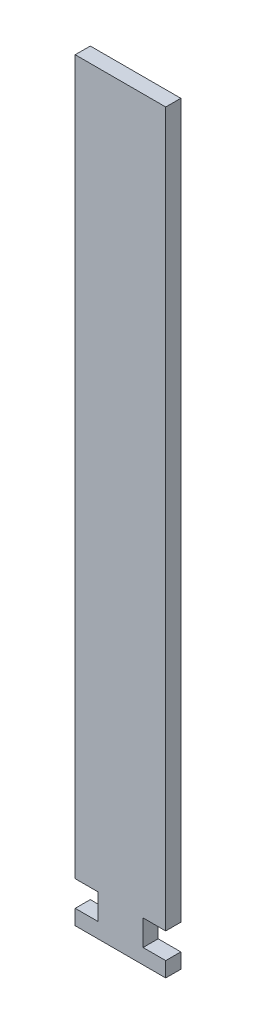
ISO-10303-21;
HEADER;
FILE_DESCRIPTION(('STEP AP214'),'2;1');
FILE_NAME('part.step','',(''),(''),'','','');
FILE_SCHEMA(('AUTOMOTIVE_DESIGN { 1 0 10303 214 1 1 1 1 }'));
ENDSEC;
DATA;
#1=APPLICATION_CONTEXT('core data for automotive mechanical design processes');
#2=APPLICATION_PROTOCOL_DEFINITION('international standard','automotive_design',2000,#1);
#3=PRODUCT_CONTEXT('',#1,'mechanical');
#4=PRODUCT('Part','Part','',(#3));
#5=PRODUCT_RELATED_PRODUCT_CATEGORY('part','',(#4));
#6=PRODUCT_DEFINITION_FORMATION('','',#4);
#7=PRODUCT_DEFINITION_CONTEXT('part definition',#1,'design');
#8=PRODUCT_DEFINITION('design','',#6,#7);
#9=PRODUCT_DEFINITION_SHAPE('','',#8);
#10=(LENGTH_UNIT() NAMED_UNIT(*) SI_UNIT(.MILLI.,.METRE.));
#11=(NAMED_UNIT(*) PLANE_ANGLE_UNIT() SI_UNIT($,.RADIAN.));
#12=(NAMED_UNIT(*) SI_UNIT($,.STERADIAN.) SOLID_ANGLE_UNIT());
#13=UNCERTAINTY_MEASURE_WITH_UNIT(LENGTH_MEASURE(1.E-05),#10,'distance_accuracy_value','');
#14=(GEOMETRIC_REPRESENTATION_CONTEXT(3) GLOBAL_UNCERTAINTY_ASSIGNED_CONTEXT((#13)) GLOBAL_UNIT_ASSIGNED_CONTEXT((#10,
#11,#12)) REPRESENTATION_CONTEXT('',''));
#15=CARTESIAN_POINT('',(0.,0.,0.));
#16=DIRECTION('',(0.,0.,1.));
#17=DIRECTION('',(1.,0.,0.));
#18=AXIS2_PLACEMENT_3D('',#15,#16,#17);
#19=CARTESIAN_POINT('',(-79.8414971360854,-49.6987951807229,10.));
#20=DIRECTION('',(1.,0.,0.));
#21=DIRECTION('',(0.,0.,-1.));
#22=AXIS2_PLACEMENT_3D('',#19,#20,#21);
#23=PLANE('',#22);
#24=DIRECTION('',(0.,-1.,0.));
#25=VECTOR('',#24,1.);
#26=CARTESIAN_POINT('',(-79.8414971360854,-49.6987951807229,0.));
#27=LINE('',#26,#25);
#28=CARTESIAN_POINT('',(-79.8414971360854,450.301204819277,0.));
#29=VERTEX_POINT('',#28);
#30=CARTESIAN_POINT('',(-79.8414971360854,-22.6987951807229,0.));
#31=VERTEX_POINT('',#30);
#32=EDGE_CURVE('E144',#29,#31,#27,.T.);
#33=ORIENTED_EDGE('',*,*,#32,.T.);
#34=DIRECTION('',(0.,0.,1.));
#35=VECTOR('',#34,1.);
#36=CARTESIAN_POINT('',(-79.8414971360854,-22.6987951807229,0.));
#37=LINE('',#36,#35);
#38=CARTESIAN_POINT('',(-79.8414971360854,-22.6987951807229,10.));
#39=VERTEX_POINT('',#38);
#40=EDGE_CURVE('E193',#31,#39,#37,.T.);
#41=ORIENTED_EDGE('',*,*,#40,.T.);
#42=DIRECTION('',(0.,-1.,0.));
#43=VECTOR('',#42,1.);
#44=CARTESIAN_POINT('',(-79.8414971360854,-49.6987951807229,10.));
#45=LINE('',#44,#43);
#46=CARTESIAN_POINT('',(-79.8414971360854,450.301204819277,10.));
#47=VERTEX_POINT('',#46);
#48=EDGE_CURVE('E200',#47,#39,#45,.T.);
#49=ORIENTED_EDGE('',*,*,#48,.F.);
#50=DIRECTION('',(0.,0.,-1.));
#51=VECTOR('',#50,1.);
#52=CARTESIAN_POINT('',(-79.8414971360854,450.301204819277,10.));
#53=LINE('',#52,#51);
#54=EDGE_CURVE('E162',#47,#29,#53,.T.);
#55=ORIENTED_EDGE('',*,*,#54,.T.);
#56=EDGE_LOOP('',(#33,#41,#49,#55));
#57=FACE_BOUND('',#56,.T.);
#58=ADVANCED_FACE('F33',(#57),#23,.F.);
#59=CARTESIAN_POINT('',(-19.8414971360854,-49.6987951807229,10.));
#60=DIRECTION('',(-1.,0.,0.));
#61=DIRECTION('',(0.,0.,1.));
#62=AXIS2_PLACEMENT_3D('',#59,#60,#61);
#63=PLANE('',#62);
#64=DIRECTION('',(0.,1.,0.));
#65=VECTOR('',#64,1.);
#66=CARTESIAN_POINT('',(-19.8414971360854,-49.6987951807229,0.));
#67=LINE('',#66,#65);
#68=CARTESIAN_POINT('',(-19.8414971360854,-49.6987951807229,0.));
#69=VERTEX_POINT('',#68);
#70=CARTESIAN_POINT('',(-19.8414971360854,-39.6987951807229,0.));
#71=VERTEX_POINT('',#70);
#72=EDGE_CURVE('E157',#69,#71,#67,.T.);
#73=ORIENTED_EDGE('',*,*,#72,.T.);
#74=DIRECTION('',(0.,0.,1.));
#75=VECTOR('',#74,1.);
#76=CARTESIAN_POINT('',(-19.8414971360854,-39.6987951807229,0.));
#77=LINE('',#76,#75);
#78=CARTESIAN_POINT('',(-19.8414971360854,-39.6987951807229,10.));
#79=VERTEX_POINT('',#78);
#80=EDGE_CURVE('E145',#71,#79,#77,.T.);
#81=ORIENTED_EDGE('',*,*,#80,.T.);
#82=DIRECTION('',(0.,1.,0.));
#83=VECTOR('',#82,1.);
#84=CARTESIAN_POINT('',(-19.8414971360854,-49.6987951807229,10.));
#85=LINE('',#84,#83);
#86=CARTESIAN_POINT('',(-19.8414971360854,-49.6987951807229,10.));
#87=VERTEX_POINT('',#86);
#88=EDGE_CURVE('E173',#87,#79,#85,.T.);
#89=ORIENTED_EDGE('',*,*,#88,.F.);
#90=DIRECTION('',(0.,0.,-1.));
#91=VECTOR('',#90,1.);
#92=CARTESIAN_POINT('',(-19.8414971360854,-49.6987951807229,10.));
#93=LINE('',#92,#91);
#94=EDGE_CURVE('E41',#87,#69,#93,.T.);
#95=ORIENTED_EDGE('',*,*,#94,.T.);
#96=EDGE_LOOP('',(#73,#81,#89,#95));
#97=FACE_BOUND('',#96,.T.);
#98=ADVANCED_FACE('F171',(#97),#63,.F.);
#99=CARTESIAN_POINT('',(-79.8414971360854,-39.6987951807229,10.));
#100=VERTEX_POINT('',#99);
#101=CARTESIAN_POINT('',(-79.8414971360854,-49.6987951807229,10.));
#102=VERTEX_POINT('',#101);
#103=EDGE_CURVE('E137',#100,#102,#45,.T.);
#104=ORIENTED_EDGE('',*,*,#103,.F.);
#105=DIRECTION('',(0.,0.,1.));
#106=VECTOR('',#105,1.);
#107=CARTESIAN_POINT('',(-79.8414971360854,-39.6987951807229,0.));
#108=LINE('',#107,#106);
#109=CARTESIAN_POINT('',(-79.8414971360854,-39.6987951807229,0.));
#110=VERTEX_POINT('',#109);
#111=EDGE_CURVE('E125',#110,#100,#108,.T.);
#112=ORIENTED_EDGE('',*,*,#111,.F.);
#113=CARTESIAN_POINT('',(-79.8414971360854,-49.6987951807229,0.));
#114=VERTEX_POINT('',#113);
#115=EDGE_CURVE('E135',#110,#114,#27,.T.);
#116=ORIENTED_EDGE('',*,*,#115,.T.);
#117=DIRECTION('',(0.,0.,-1.));
#118=VECTOR('',#117,1.);
#119=CARTESIAN_POINT('',(-79.8414971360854,-49.6987951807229,10.));
#120=LINE('',#119,#118);
#121=EDGE_CURVE('E11',#102,#114,#120,.T.);
#122=ORIENTED_EDGE('',*,*,#121,.F.);
#123=EDGE_LOOP('',(#104,#112,#116,#122));
#124=FACE_BOUND('',#123,.T.);
#125=ADVANCED_FACE('F35',(#124),#23,.F.);
#126=CARTESIAN_POINT('',(-79.8414971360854,-49.6987951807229,10.));
#127=DIRECTION('',(0.,1.,0.));
#128=DIRECTION('',(0.,0.,1.));
#129=AXIS2_PLACEMENT_3D('',#126,#127,#128);
#130=PLANE('',#129);
#131=DIRECTION('',(1.,0.,0.));
#132=VECTOR('',#131,1.);
#133=CARTESIAN_POINT('',(-79.8414971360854,-49.6987951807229,0.));
#134=LINE('',#133,#132);
#135=EDGE_CURVE('E143',#114,#69,#134,.T.);
#136=ORIENTED_EDGE('',*,*,#135,.T.);
#137=ORIENTED_EDGE('',*,*,#94,.F.);
#138=DIRECTION('',(1.,0.,0.));
#139=VECTOR('',#138,1.);
#140=CARTESIAN_POINT('',(-79.8414971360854,-49.6987951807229,10.));
#141=LINE('',#140,#139);
#142=EDGE_CURVE('E203',#102,#87,#141,.T.);
#143=ORIENTED_EDGE('',*,*,#142,.F.);
#144=ORIENTED_EDGE('',*,*,#121,.T.);
#145=EDGE_LOOP('',(#136,#137,#143,#144));
#146=FACE_BOUND('',#145,.T.);
#147=ADVANCED_FACE('F259',(#146),#130,.F.);
#148=CARTESIAN_POINT('',(-19.8414971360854,-22.6987951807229,10.));
#149=VERTEX_POINT('',#148);
#150=CARTESIAN_POINT('',(-19.8414971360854,450.301204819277,10.));
#151=VERTEX_POINT('',#150);
#152=EDGE_CURVE('E204',#149,#151,#85,.T.);
#153=ORIENTED_EDGE('',*,*,#152,.F.);
#154=DIRECTION('',(0.,0.,1.));
#155=VECTOR('',#154,1.);
#156=CARTESIAN_POINT('',(-19.8414971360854,-22.6987951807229,0.));
#157=LINE('',#156,#155);
#158=CARTESIAN_POINT('',(-19.8414971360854,-22.6987951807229,0.));
#159=VERTEX_POINT('',#158);
#160=EDGE_CURVE('E181',#159,#149,#157,.T.);
#161=ORIENTED_EDGE('',*,*,#160,.F.);
#162=CARTESIAN_POINT('',(-19.8414971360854,450.301204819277,0.));
#163=VERTEX_POINT('',#162);
#164=EDGE_CURVE('E156',#159,#163,#67,.T.);
#165=ORIENTED_EDGE('',*,*,#164,.T.);
#166=DIRECTION('',(0.,0.,-1.));
#167=VECTOR('',#166,1.);
#168=CARTESIAN_POINT('',(-19.8414971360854,450.301204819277,10.));
#169=LINE('',#168,#167);
#170=EDGE_CURVE('E165',#151,#163,#169,.T.);
#171=ORIENTED_EDGE('',*,*,#170,.F.);
#172=EDGE_LOOP('',(#153,#161,#165,#171));
#173=FACE_BOUND('',#172,.T.);
#174=ADVANCED_FACE('F216',(#173),#63,.F.);
#175=CARTESIAN_POINT('',(-79.8414971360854,450.301204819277,10.));
#176=DIRECTION('',(0.,-1.,0.));
#177=DIRECTION('',(0.,0.,-1.));
#178=AXIS2_PLACEMENT_3D('',#175,#176,#177);
#179=PLANE('',#178);
#180=DIRECTION('',(-1.,0.,0.));
#181=VECTOR('',#180,1.);
#182=CARTESIAN_POINT('',(-79.8414971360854,450.301204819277,0.));
#183=LINE('',#182,#181);
#184=EDGE_CURVE('E160',#163,#29,#183,.T.);
#185=ORIENTED_EDGE('',*,*,#184,.T.);
#186=ORIENTED_EDGE('',*,*,#54,.F.);
#187=DIRECTION('',(-1.,0.,0.));
#188=VECTOR('',#187,1.);
#189=CARTESIAN_POINT('',(-79.8414971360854,450.301204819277,10.));
#190=LINE('',#189,#188);
#191=EDGE_CURVE('E153',#151,#47,#190,.T.);
#192=ORIENTED_EDGE('',*,*,#191,.F.);
#193=ORIENTED_EDGE('',*,*,#170,.T.);
#194=EDGE_LOOP('',(#185,#186,#192,#193));
#195=FACE_BOUND('',#194,.T.);
#196=ADVANCED_FACE('F220',(#195),#179,.F.);
#197=CARTESIAN_POINT('',(0.,0.,10.));
#198=DIRECTION('',(0.,0.,-1.));
#199=DIRECTION('',(-1.,0.,0.));
#200=AXIS2_PLACEMENT_3D('',#197,#198,#199);
#201=PLANE('',#200);
#202=ORIENTED_EDGE('',*,*,#48,.T.);
#203=DIRECTION('',(-1.,0.,0.));
#204=VECTOR('',#203,1.);
#205=CARTESIAN_POINT('',(-79.8414971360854,-22.6987951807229,10.));
#206=LINE('',#205,#204);
#207=CARTESIAN_POINT('',(-64.8414971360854,-22.6987951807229,10.));
#208=VERTEX_POINT('',#207);
#209=EDGE_CURVE('E130',#208,#39,#206,.T.);
#210=ORIENTED_EDGE('',*,*,#209,.F.);
#211=DIRECTION('',(0.,1.,0.));
#212=VECTOR('',#211,1.);
#213=CARTESIAN_POINT('',(-64.8414971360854,-39.6987951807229,10.));
#214=LINE('',#213,#212);
#215=CARTESIAN_POINT('',(-64.8414971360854,-39.6987951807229,10.));
#216=VERTEX_POINT('',#215);
#217=EDGE_CURVE('E228',#216,#208,#214,.T.);
#218=ORIENTED_EDGE('',*,*,#217,.F.);
#219=DIRECTION('',(1.,0.,0.));
#220=VECTOR('',#219,1.);
#221=CARTESIAN_POINT('',(-79.8414971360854,-39.6987951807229,10.));
#222=LINE('',#221,#220);
#223=EDGE_CURVE('E231',#100,#216,#222,.T.);
#224=ORIENTED_EDGE('',*,*,#223,.F.);
#225=ORIENTED_EDGE('',*,*,#103,.T.);
#226=ORIENTED_EDGE('',*,*,#142,.T.);
#227=ORIENTED_EDGE('',*,*,#88,.T.);
#228=DIRECTION('',(1.,0.,0.));
#229=VECTOR('',#228,1.);
#230=CARTESIAN_POINT('',(-19.8414971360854,-39.6987951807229,10.));
#231=LINE('',#230,#229);
#232=CARTESIAN_POINT('',(-34.8414971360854,-39.6987951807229,10.));
#233=VERTEX_POINT('',#232);
#234=EDGE_CURVE('E196',#233,#79,#231,.T.);
#235=ORIENTED_EDGE('',*,*,#234,.F.);
#236=DIRECTION('',(0.,-1.,0.));
#237=VECTOR('',#236,1.);
#238=CARTESIAN_POINT('',(-34.8414971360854,-39.6987951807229,10.));
#239=LINE('',#238,#237);
#240=CARTESIAN_POINT('',(-34.8414971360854,-22.6987951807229,10.));
#241=VERTEX_POINT('',#240);
#242=EDGE_CURVE('E192',#241,#233,#239,.T.);
#243=ORIENTED_EDGE('',*,*,#242,.F.);
#244=DIRECTION('',(-1.,0.,0.));
#245=VECTOR('',#244,1.);
#246=CARTESIAN_POINT('',(-19.8414971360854,-22.6987951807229,10.));
#247=LINE('',#246,#245);
#248=EDGE_CURVE('E189',#149,#241,#247,.T.);
#249=ORIENTED_EDGE('',*,*,#248,.F.);
#250=ORIENTED_EDGE('',*,*,#152,.T.);
#251=ORIENTED_EDGE('',*,*,#191,.T.);
#252=EDGE_LOOP('',(#202,#210,#218,#224,#225,#226,#227,#235,#243,#249,#250,#251));
#253=FACE_BOUND('',#252,.T.);
#254=ADVANCED_FACE('F210',(#253),#201,.F.);
#255=CARTESIAN_POINT('',(0.,0.,0.));
#256=DIRECTION('',(0.,0.,-1.));
#257=DIRECTION('',(-1.,0.,0.));
#258=AXIS2_PLACEMENT_3D('',#255,#256,#257);
#259=PLANE('',#258);
#260=DIRECTION('',(-1.,0.,0.));
#261=VECTOR('',#260,1.);
#262=CARTESIAN_POINT('',(-79.8414971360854,-22.6987951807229,0.));
#263=LINE('',#262,#261);
#264=CARTESIAN_POINT('',(-64.8414971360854,-22.6987951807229,0.));
#265=VERTEX_POINT('',#264);
#266=EDGE_CURVE('E138',#265,#31,#263,.T.);
#267=ORIENTED_EDGE('',*,*,#266,.T.);
#268=ORIENTED_EDGE('',*,*,#32,.F.);
#269=ORIENTED_EDGE('',*,*,#184,.F.);
#270=ORIENTED_EDGE('',*,*,#164,.F.);
#271=DIRECTION('',(-1.,0.,0.));
#272=VECTOR('',#271,1.);
#273=CARTESIAN_POINT('',(-19.8414971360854,-22.6987951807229,0.));
#274=LINE('',#273,#272);
#275=CARTESIAN_POINT('',(-34.8414971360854,-22.6987951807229,0.));
#276=VERTEX_POINT('',#275);
#277=EDGE_CURVE('E185',#159,#276,#274,.T.);
#278=ORIENTED_EDGE('',*,*,#277,.T.);
#279=DIRECTION('',(0.,-1.,0.));
#280=VECTOR('',#279,1.);
#281=CARTESIAN_POINT('',(-34.8414971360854,-39.6987951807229,0.));
#282=LINE('',#281,#280);
#283=CARTESIAN_POINT('',(-34.8414971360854,-39.6987951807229,0.));
#284=VERTEX_POINT('',#283);
#285=EDGE_CURVE('E56',#276,#284,#282,.T.);
#286=ORIENTED_EDGE('',*,*,#285,.T.);
#287=DIRECTION('',(1.,0.,0.));
#288=VECTOR('',#287,1.);
#289=CARTESIAN_POINT('',(-19.8414971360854,-39.6987951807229,0.));
#290=LINE('',#289,#288);
#291=EDGE_CURVE('E178',#284,#71,#290,.T.);
#292=ORIENTED_EDGE('',*,*,#291,.T.);
#293=ORIENTED_EDGE('',*,*,#72,.F.);
#294=ORIENTED_EDGE('',*,*,#135,.F.);
#295=ORIENTED_EDGE('',*,*,#115,.F.);
#296=DIRECTION('',(1.,0.,0.));
#297=VECTOR('',#296,1.);
#298=CARTESIAN_POINT('',(-79.8414971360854,-39.6987951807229,0.));
#299=LINE('',#298,#297);
#300=CARTESIAN_POINT('',(-64.8414971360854,-39.6987951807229,0.));
#301=VERTEX_POINT('',#300);
#302=EDGE_CURVE('E121',#110,#301,#299,.T.);
#303=ORIENTED_EDGE('',*,*,#302,.T.);
#304=DIRECTION('',(0.,1.,0.));
#305=VECTOR('',#304,1.);
#306=CARTESIAN_POINT('',(-64.8414971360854,-39.6987951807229,0.));
#307=LINE('',#306,#305);
#308=EDGE_CURVE('E48',#301,#265,#307,.T.);
#309=ORIENTED_EDGE('',*,*,#308,.T.);
#310=EDGE_LOOP('',(#267,#268,#269,#270,#278,#286,#292,#293,#294,#295,#303,#309));
#311=FACE_BOUND('',#310,.T.);
#312=ADVANCED_FACE('F141',(#311),#259,.T.);
#313=CARTESIAN_POINT('',(-19.8414971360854,-39.6987951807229,0.));
#314=DIRECTION('',(0.,-1.,0.));
#315=DIRECTION('',(0.,0.,-1.));
#316=AXIS2_PLACEMENT_3D('',#313,#314,#315);
#317=PLANE('',#316);
#318=ORIENTED_EDGE('',*,*,#234,.T.);
#319=ORIENTED_EDGE('',*,*,#80,.F.);
#320=ORIENTED_EDGE('',*,*,#291,.F.);
#321=DIRECTION('',(0.,0.,1.));
#322=VECTOR('',#321,1.);
#323=CARTESIAN_POINT('',(-34.8414971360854,-39.6987951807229,0.));
#324=LINE('',#323,#322);
#325=EDGE_CURVE('E149',#284,#233,#324,.T.);
#326=ORIENTED_EDGE('',*,*,#325,.T.);
#327=EDGE_LOOP('',(#318,#319,#320,#326));
#328=FACE_BOUND('',#327,.T.);
#329=ADVANCED_FACE('F241',(#328),#317,.F.);
#330=CARTESIAN_POINT('',(-34.8414971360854,-39.6987951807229,0.));
#331=DIRECTION('',(-1.,0.,0.));
#332=DIRECTION('',(0.,0.,1.));
#333=AXIS2_PLACEMENT_3D('',#330,#331,#332);
#334=PLANE('',#333);
#335=ORIENTED_EDGE('',*,*,#242,.T.);
#336=ORIENTED_EDGE('',*,*,#325,.F.);
#337=ORIENTED_EDGE('',*,*,#285,.F.);
#338=DIRECTION('',(0.,0.,1.));
#339=VECTOR('',#338,1.);
#340=CARTESIAN_POINT('',(-34.8414971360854,-22.6987951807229,0.));
#341=LINE('',#340,#339);
#342=EDGE_CURVE('E183',#276,#241,#341,.T.);
#343=ORIENTED_EDGE('',*,*,#342,.T.);
#344=EDGE_LOOP('',(#335,#336,#337,#343));
#345=FACE_BOUND('',#344,.T.);
#346=ADVANCED_FACE('F240',(#345),#334,.F.);
#347=CARTESIAN_POINT('',(-19.8414971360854,-22.6987951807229,0.));
#348=DIRECTION('',(0.,1.,0.));
#349=DIRECTION('',(-1.,0.,0.));
#350=AXIS2_PLACEMENT_3D('',#347,#348,#349);
#351=PLANE('',#350);
#352=ORIENTED_EDGE('',*,*,#248,.T.);
#353=ORIENTED_EDGE('',*,*,#342,.F.);
#354=ORIENTED_EDGE('',*,*,#277,.F.);
#355=ORIENTED_EDGE('',*,*,#160,.T.);
#356=EDGE_LOOP('',(#352,#353,#354,#355));
#357=FACE_BOUND('',#356,.T.);
#358=ADVANCED_FACE('F239',(#357),#351,.F.);
#359=CARTESIAN_POINT('',(-79.8414971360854,-22.6987951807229,0.));
#360=DIRECTION('',(0.,1.,0.));
#361=DIRECTION('',(0.,0.,1.));
#362=AXIS2_PLACEMENT_3D('',#359,#360,#361);
#363=PLANE('',#362);
#364=ORIENTED_EDGE('',*,*,#209,.T.);
#365=ORIENTED_EDGE('',*,*,#40,.F.);
#366=ORIENTED_EDGE('',*,*,#266,.F.);
#367=DIRECTION('',(0.,0.,1.));
#368=VECTOR('',#367,1.);
#369=CARTESIAN_POINT('',(-64.8414971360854,-22.6987951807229,0.));
#370=LINE('',#369,#368);
#371=EDGE_CURVE('E236',#265,#208,#370,.T.);
#372=ORIENTED_EDGE('',*,*,#371,.T.);
#373=EDGE_LOOP('',(#364,#365,#366,#372));
#374=FACE_BOUND('',#373,.T.);
#375=ADVANCED_FACE('F273',(#374),#363,.F.);
#376=CARTESIAN_POINT('',(-64.8414971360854,-39.6987951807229,0.));
#377=DIRECTION('',(1.,0.,0.));
#378=DIRECTION('',(0.,0.,-1.));
#379=AXIS2_PLACEMENT_3D('',#376,#377,#378);
#380=PLANE('',#379);
#381=ORIENTED_EDGE('',*,*,#217,.T.);
#382=ORIENTED_EDGE('',*,*,#371,.F.);
#383=ORIENTED_EDGE('',*,*,#308,.F.);
#384=DIRECTION('',(0.,0.,1.));
#385=VECTOR('',#384,1.);
#386=CARTESIAN_POINT('',(-64.8414971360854,-39.6987951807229,0.));
#387=LINE('',#386,#385);
#388=EDGE_CURVE('E127',#301,#216,#387,.T.);
#389=ORIENTED_EDGE('',*,*,#388,.T.);
#390=EDGE_LOOP('',(#381,#382,#383,#389));
#391=FACE_BOUND('',#390,.T.);
#392=ADVANCED_FACE('F277',(#391),#380,.F.);
#393=CARTESIAN_POINT('',(-79.8414971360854,-39.6987951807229,0.));
#394=DIRECTION('',(0.,-1.,0.));
#395=DIRECTION('',(0.,0.,-1.));
#396=AXIS2_PLACEMENT_3D('',#393,#394,#395);
#397=PLANE('',#396);
#398=ORIENTED_EDGE('',*,*,#223,.T.);
#399=ORIENTED_EDGE('',*,*,#388,.F.);
#400=ORIENTED_EDGE('',*,*,#302,.F.);
#401=ORIENTED_EDGE('',*,*,#111,.T.);
#402=EDGE_LOOP('',(#398,#399,#400,#401));
#403=FACE_BOUND('',#402,.T.);
#404=ADVANCED_FACE('F124',(#403),#397,.F.);
#405=CLOSED_SHELL('',(#58,#98,#125,#147,#174,#196,#254,#312,#329,#346,#358,#375,#392,#404));
#406=MANIFOLD_SOLID_BREP('B2',#405);
#407=ADVANCED_BREP_SHAPE_REPRESENTATION('',(#18,#406),#14);
#408=SHAPE_DEFINITION_REPRESENTATION(#9,#407);
ENDSEC;
END-ISO-10303-21;
